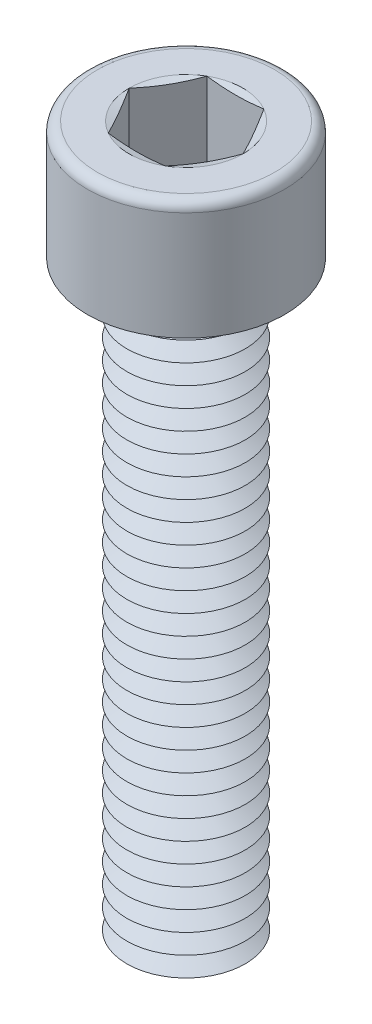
from build123d import *

# Parameters (mm, degrees)
SKETCH1_R       = 3
EXTRUDE1_DEPTH  = 30
SKETCH2_R       = 5
EXTRUDE2_DEPTH  = 6
EXTRUDE3_DEPTH  = 5
FILLET1_R       = 0.5
LPATTERN1_COUNT = 30
LPATTERN1_PITCH = 1


with BuildPart() as part:
    # Sketch1 → Extrude1 (new body)
    with BuildSketch(Plane(origin=(0, 0, 0), x_dir=(1, 0, 0), z_dir=(0, 1, 0))):
        with Locations(Location((0, 0, 0), (0, 0, 270))):
            Circle(SKETCH1_R)
    extrude(amount=EXTRUDE1_DEPTH)

    # Sketch2 → Extrude2 (add)
    with BuildSketch(Plane(origin=(0, 30, 0), x_dir=(1, 0, 0), z_dir=(0, 1, 0))):
        with Locations(Location((0, 0, 0), (0, 0, 270))):
            Circle(SKETCH2_R)
    extrude(amount=EXTRUDE2_DEPTH)

    # Sketch3 → Extrude3 (cut)
    with BuildSketch(Plane(origin=(0, 36, 0), x_dir=(1, 0, 0), z_dir=(0, 1, 0))):
        Polygon((1.443375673, 2.5), (-1.443375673, 2.5), (-2.886751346, 0), (-1.443375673, -2.5), (1.443375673, -2.5), (2.886751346, 0), align=None)
    extrude(amount=-EXTRUDE3_DEPTH, mode=Mode.SUBTRACT)

    # Fillet1
    fillet1_edges = [part.edges().sort_by_distance(p)[0] for p in [
        (0, 36, -5),
    ]]
    fillet(fillet1_edges, radius=FILLET1_R)

    # Sketch4 → Cut-Revolve1 (revolve, cut)
    with BuildSketch(Plane(origin=(0, 0, 0), x_dir=(0, 0, -1), z_dir=(1, 0, 0))):
        Polygon((-2.5, 31), (0, 31), (0, 29.556624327), align=None)
    revolve(axis=Axis((0, 31, 0), (0, -1, 0)), mode=Mode.SUBTRACT)

    # Sketch5 → Cut-Revolve2 (revolve, cut)
    with BuildSketch(Plane.XY, mode=Mode.PRIVATE) as cut_revolve2_sk:
        Polygon((-3, 0.5), (-3, -0.5), (-2.133974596, 0), align=None)
    cut_revolve2 = revolve(cut_revolve2_sk.sketch.rotate(Axis((0, 30, 0), (0, -1, 0)), 270), axis=Axis((0, 30, 0), (0, -1, 0)), mode=Mode.SUBTRACT)

    # LPattern1: Cut-Revolve2 ×30
    with Locations(*[(0, i * LPATTERN1_PITCH, 0) for i in range(1, LPATTERN1_COUNT)]):
        add(cut_revolve2, mode=Mode.SUBTRACT)

    # Extrude4 cone 1 section (on through the dimple's axis) → Extrude4 (revolve, cut)
    with BuildSketch(Plane(origin=(0, 36, 0), x_dir=(0, 0, 1), z_dir=(1, 0, 0))):
        Polygon((0, 0), (2.886751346, 0), (0, 0.773502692), align=None)
    revolve(axis=Axis((0, 36, 0), (0, -1, 0)), mode=Mode.SUBTRACT)


solid = part.part
